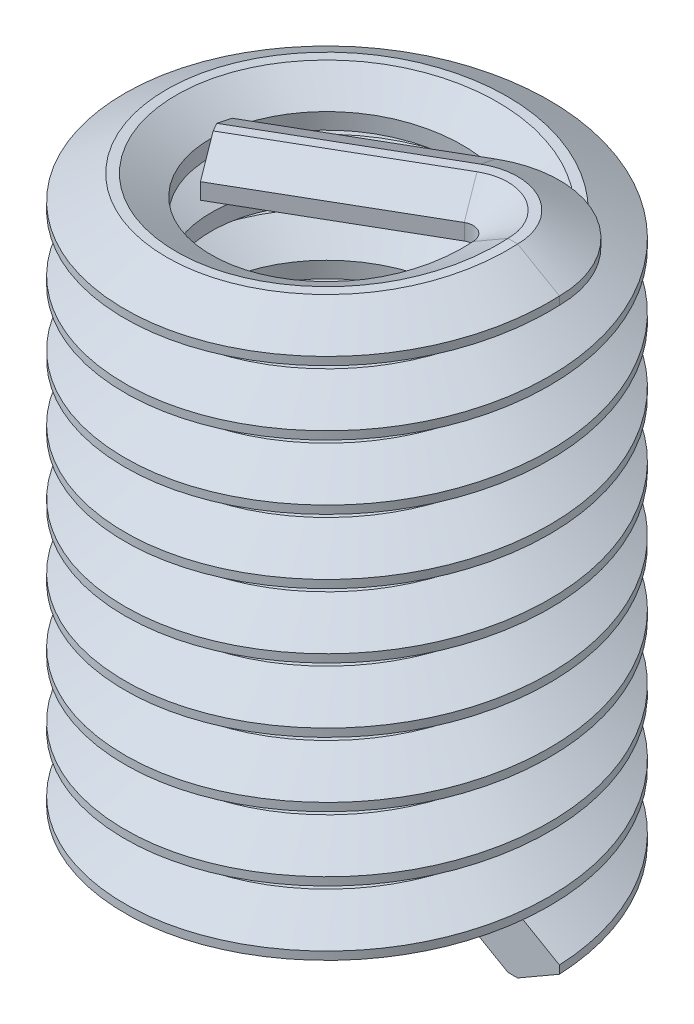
from build123d import *

# Parameters (mm, degrees)
SWEEP1_PITCH       = 1.27
SWEEP1_HEIGHT      = 11.43
SWEEP1_RADIUS      = 3.175
SWEEP1_START_ANGLE = 90
REVOLVE1_ANGLE     = 120
EXTRUDE1_DEPTH     = 3.81


with BuildPart() as part:
    # Sweep1: sweep along a helix
    with BuildLine() as sweep1_path:
        add(Helix(SWEEP1_PITCH, SWEEP1_HEIGHT, SWEEP1_RADIUS, center=(0, 0, 0), direction=(0, 1, 0), mode=Mode.PRIVATE).rotate(Axis((0, 0, 0), (0, 1, 0)), SWEEP1_START_ANGLE))
    # Sketch1 → Sweep1 (sweep)
    with BuildSketch(Plane(origin=(0, 0, 0), x_dir=(-1, 0, 0), z_dir=(0, 0, 1))):
        Polygon((-4.191, -0.079375), (-3.366110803, -0.555625), (-3.175, -0.555625), (-2.487592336, -0.15875), (-2.487592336, 0.15875), (-3.175, 0.555625), (-3.366110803, 0.555625), (-4.191, 0.079375), align=None)
    sweep(path=sweep1_path.line, is_frenet=True)


with BuildPart() as body_2:
    # Sketch3 → Revolve1 (revolve)
    with BuildSketch(Plane(origin=(0, 0, 0), x_dir=(-1, 0, 0), z_dir=(0, 0, -1))):
        Polygon((-3.175, 10.874375), (-2.487592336, 11.27125), (-2.487592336, 11.58875), (-3.175, 11.985625), (-3.366110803, 11.985625), (-4.191, 11.509375), (-4.191, 11.350625), (-3.366110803, 10.874375), align=None)
    revolve(axis=Axis((2.21262927, 11.43, 0), (0, 1, 0)), revolution_arc=REVOLVE1_ANGLE)

    # Sketch4 → Extrude1 (add)
    with BuildSketch(Plane(origin=(1.659471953, 0, -0.958096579), x_dir=(0.500000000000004, 0, 0.8660254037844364), z_dir=(-0.8660254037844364, 1.182924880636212e-15, 0.500000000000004))):
        Polygon((-0.047166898, 10.874375), (0.143943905, 10.874375), (0.831351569, 11.27125), (0.831351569, 11.58875), (0.143943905, 11.985625), (-0.047166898, 11.985625), (-0.872056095, 11.509375), (-0.872056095, 11.350625), align=None)
    extrude(amount=EXTRUDE1_DEPTH)


solid = Compound([part.part, body_2.part])
